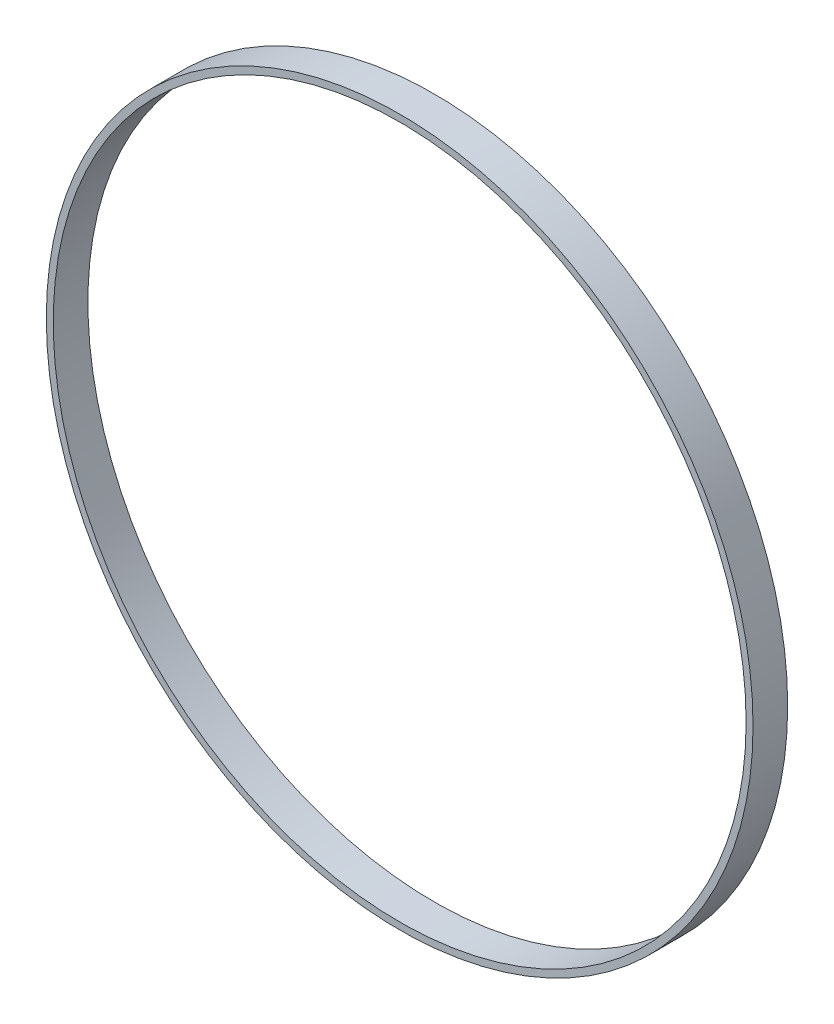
ISO-10303-21;
HEADER;
FILE_DESCRIPTION(('STEP AP214'),'2;1');
FILE_NAME('part.step','',(''),(''),'','','');
FILE_SCHEMA(('AUTOMOTIVE_DESIGN { 1 0 10303 214 1 1 1 1 }'));
ENDSEC;
DATA;
#1=APPLICATION_CONTEXT('core data for automotive mechanical design processes');
#2=APPLICATION_PROTOCOL_DEFINITION('international standard','automotive_design',2000,#1);
#3=PRODUCT_CONTEXT('',#1,'mechanical');
#4=PRODUCT('Part','Part','',(#3));
#5=PRODUCT_RELATED_PRODUCT_CATEGORY('part','',(#4));
#6=PRODUCT_DEFINITION_FORMATION('','',#4);
#7=PRODUCT_DEFINITION_CONTEXT('part definition',#1,'design');
#8=PRODUCT_DEFINITION('design','',#6,#7);
#9=PRODUCT_DEFINITION_SHAPE('','',#8);
#10=(LENGTH_UNIT() NAMED_UNIT(*) SI_UNIT(.MILLI.,.METRE.));
#11=(NAMED_UNIT(*) PLANE_ANGLE_UNIT() SI_UNIT($,.RADIAN.));
#12=(NAMED_UNIT(*) SI_UNIT($,.STERADIAN.) SOLID_ANGLE_UNIT());
#13=UNCERTAINTY_MEASURE_WITH_UNIT(LENGTH_MEASURE(1.E-05),#10,'distance_accuracy_value','');
#14=(GEOMETRIC_REPRESENTATION_CONTEXT(3) GLOBAL_UNCERTAINTY_ASSIGNED_CONTEXT((#13)) GLOBAL_UNIT_ASSIGNED_CONTEXT((#10,
#11,#12)) REPRESENTATION_CONTEXT('',''));
#15=CARTESIAN_POINT('',(0.,0.,0.));
#16=DIRECTION('',(0.,0.,1.));
#17=DIRECTION('',(1.,0.,0.));
#18=AXIS2_PLACEMENT_3D('',#15,#16,#17);
#19=CARTESIAN_POINT('',(0.,0.,5.));
#20=DIRECTION('',(0.,0.,1.));
#21=DIRECTION('',(1.,0.,0.));
#22=AXIS2_PLACEMENT_3D('',#19,#20,#21);
#23=PLANE('',#22);
#24=CARTESIAN_POINT('',(0.,0.,5.));
#25=DIRECTION('',(0.,0.,1.));
#26=DIRECTION('',(1.,0.,0.));
#27=AXIS2_PLACEMENT_3D('',#24,#25,#26);
#28=CIRCLE('',#27,51.);
#29=CARTESIAN_POINT('',(51.,0.,5.));
#30=VERTEX_POINT('',#29);
#31=EDGE_CURVE('E10',#30,#30,#28,.T.);
#32=ORIENTED_EDGE('',*,*,#31,.T.);
#33=EDGE_LOOP('',(#32));
#34=FACE_BOUND('',#33,.T.);
#35=CARTESIAN_POINT('',(0.,0.,5.));
#36=DIRECTION('',(0.,0.,1.));
#37=DIRECTION('',(1.,0.,0.));
#38=AXIS2_PLACEMENT_3D('',#35,#36,#37);
#39=CIRCLE('',#38,50.);
#40=CARTESIAN_POINT('',(50.,0.,5.));
#41=VERTEX_POINT('',#40);
#42=EDGE_CURVE('E35',#41,#41,#39,.T.);
#43=ORIENTED_EDGE('',*,*,#42,.F.);
#44=EDGE_LOOP('',(#43));
#45=FACE_BOUND('',#44,.T.);
#46=ADVANCED_FACE('F24',(#34,#45),#23,.T.);
#47=CARTESIAN_POINT('',(0.,0.,0.));
#48=DIRECTION('',(0.,0.,1.));
#49=DIRECTION('',(1.,0.,0.));
#50=AXIS2_PLACEMENT_3D('',#47,#48,#49);
#51=PLANE('',#50);
#52=CARTESIAN_POINT('',(0.,0.,0.));
#53=DIRECTION('',(0.,0.,1.));
#54=DIRECTION('',(1.,0.,0.));
#55=AXIS2_PLACEMENT_3D('',#52,#53,#54);
#56=CIRCLE('',#55,51.);
#57=CARTESIAN_POINT('',(51.,0.,0.));
#58=VERTEX_POINT('',#57);
#59=EDGE_CURVE('E31',#58,#58,#56,.T.);
#60=ORIENTED_EDGE('',*,*,#59,.F.);
#61=EDGE_LOOP('',(#60));
#62=FACE_BOUND('',#61,.T.);
#63=CARTESIAN_POINT('',(0.,0.,0.));
#64=DIRECTION('',(0.,0.,1.));
#65=DIRECTION('',(1.,0.,0.));
#66=AXIS2_PLACEMENT_3D('',#63,#64,#65);
#67=CIRCLE('',#66,50.);
#68=CARTESIAN_POINT('',(50.,0.,0.));
#69=VERTEX_POINT('',#68);
#70=EDGE_CURVE('E39',#69,#69,#67,.T.);
#71=ORIENTED_EDGE('',*,*,#70,.T.);
#72=EDGE_LOOP('',(#71));
#73=FACE_BOUND('',#72,.T.);
#74=ADVANCED_FACE('F45',(#62,#73),#51,.F.);
#75=CARTESIAN_POINT('',(0.,0.,5.));
#76=DIRECTION('',(0.,0.,-1.));
#77=DIRECTION('',(-1.,0.,0.));
#78=AXIS2_PLACEMENT_3D('',#75,#76,#77);
#79=CYLINDRICAL_SURFACE('',#78,51.);
#80=ORIENTED_EDGE('',*,*,#31,.F.);
#81=EDGE_LOOP('',(#80));
#82=FACE_BOUND('',#81,.T.);
#83=ORIENTED_EDGE('',*,*,#59,.T.);
#84=EDGE_LOOP('',(#83));
#85=FACE_BOUND('',#84,.T.);
#86=ADVANCED_FACE('F26',(#82,#85),#79,.T.);
#87=CARTESIAN_POINT('',(0.,0.,5.));
#88=DIRECTION('',(0.,0.,-1.));
#89=DIRECTION('',(-1.,0.,0.));
#90=AXIS2_PLACEMENT_3D('',#87,#88,#89);
#91=CYLINDRICAL_SURFACE('',#90,50.);
#92=ORIENTED_EDGE('',*,*,#42,.T.);
#93=EDGE_LOOP('',(#92));
#94=FACE_BOUND('',#93,.T.);
#95=ORIENTED_EDGE('',*,*,#70,.F.);
#96=EDGE_LOOP('',(#95));
#97=FACE_BOUND('',#96,.T.);
#98=ADVANCED_FACE('F47',(#94,#97),#91,.F.);
#99=CLOSED_SHELL('',(#46,#74,#86,#98));
#100=MANIFOLD_SOLID_BREP('B2',#99);
#101=ADVANCED_BREP_SHAPE_REPRESENTATION('',(#18,#100),#14);
#102=SHAPE_DEFINITION_REPRESENTATION(#9,#101);
ENDSEC;
END-ISO-10303-21;
